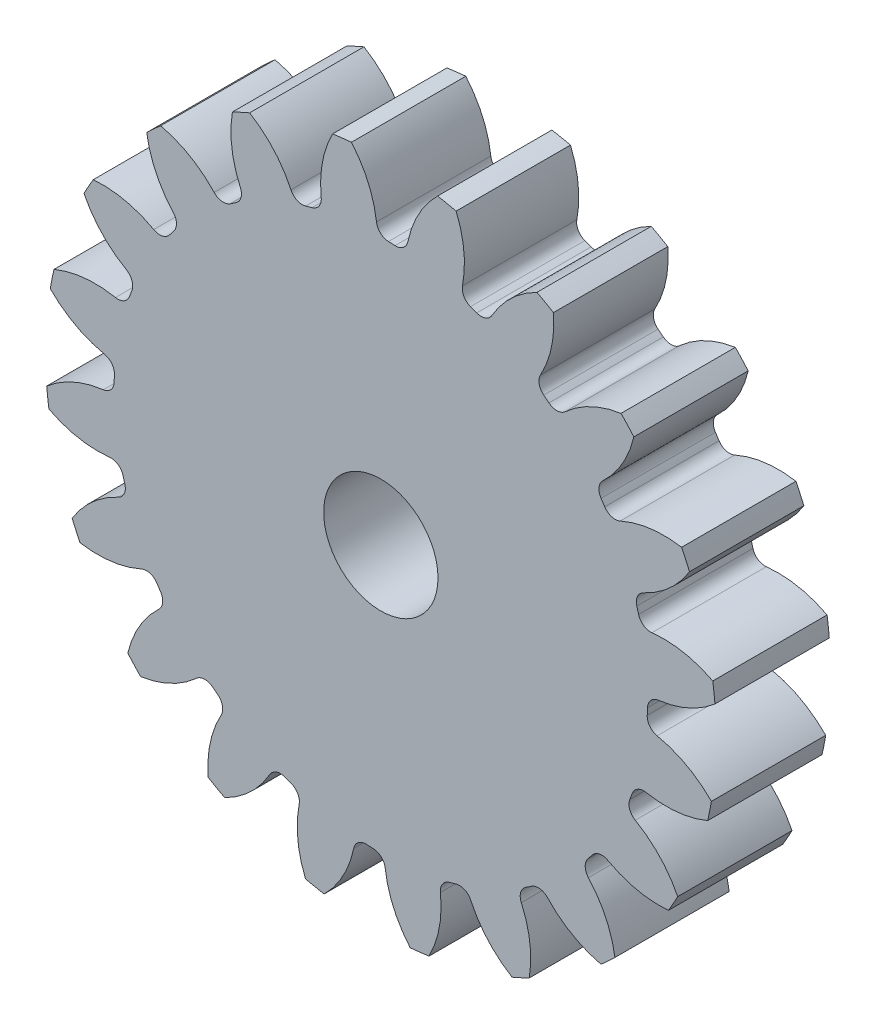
from build123d import *

# Parameters (mm, degrees)
SKETCH3_R         = 372.533333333
GEARBODY_DEPTH    = 127
TOOTHCUT_DEPTH    = 542.932808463
CIRPATTERN1_COUNT = 20
BOREDIA_R         = 63.5
BORE_DEPTH        = 12700


with BuildPart() as part:
    # Sketch3 → gearBody (new body)
    with BuildSketch(Plane.XY):
        Circle(SKETCH3_R)
    extrude(amount=GEARBODY_DEPTH)

    # Sketch2 → toothCut (cut, through all)
    with BuildSketch(Plane.XY):
        with BuildLine():
            ThreePointArc((295.90891968, -15.854201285), (296.083403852, -12.168089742), (296.211972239, -8.480091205))
            ThreePointArc((296.211972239, -8.480091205), (299.800887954, 0.408354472), (308.317555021, 4.807350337))
            ThreePointArc((308.317555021, 4.807350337), (342.651910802, 14.439768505), (372.533333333, 33.900807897))
            ThreePointArc((372.533333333, 33.900807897), (373.757156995, -15.360234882), (368.495341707, -64.354738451))
            ThreePointArc((368.495341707, -64.354738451), (340.311562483, -42.507403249), (306.883377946, -30.090159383))
            ThreePointArc((306.883377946, -30.090159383), (298.756390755, -25.007162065), (295.90891968, -15.854201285))
        make_face()
    toothcut = extrude(amount=TOOTHCUT_DEPTH, mode=Mode.SUBTRACT)

    # CirPattern1: toothCut ×20 about axis
    cirpattern1_axis = Axis((0, 0, 0), (0, 0, 1))
    for i in range(1, CIRPATTERN1_COUNT):
        add(toothcut.rotate(cirpattern1_axis, i * 360 / CIRPATTERN1_COUNT), mode=Mode.SUBTRACT)

    # boreDia → bore (cut, symmetric)
    with BuildSketch(Plane.XY):
        Circle(BOREDIA_R)
    extrude(amount=BORE_DEPTH, both=True, mode=Mode.SUBTRACT)


solid = part.part
